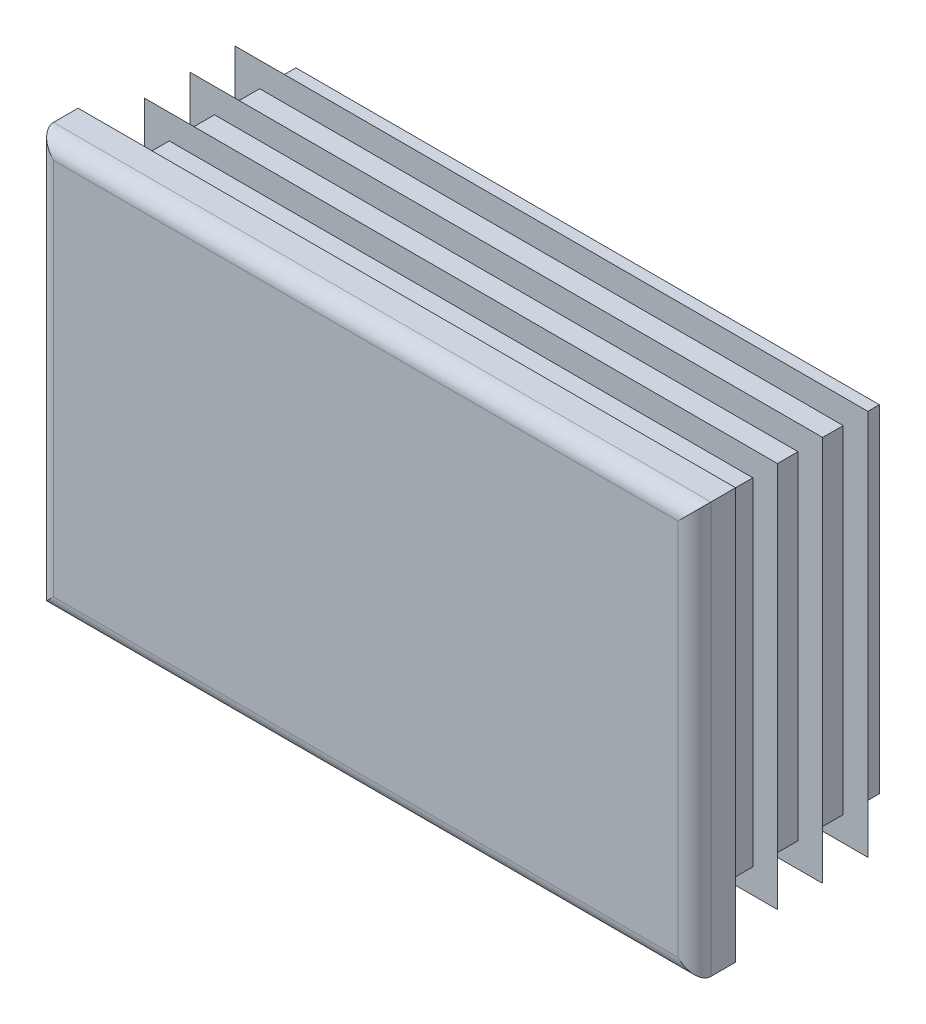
ISO-10303-21;
HEADER;
FILE_DESCRIPTION(('STEP AP214'),'2;1');
FILE_NAME('part.step','',(''),(''),'','','');
FILE_SCHEMA(('AUTOMOTIVE_DESIGN { 1 0 10303 214 1 1 1 1 }'));
ENDSEC;
DATA;
#1=APPLICATION_CONTEXT('core data for automotive mechanical design processes');
#2=APPLICATION_PROTOCOL_DEFINITION('international standard','automotive_design',2000,#1);
#3=PRODUCT_CONTEXT('',#1,'mechanical');
#4=PRODUCT('Part','Part','',(#3));
#5=PRODUCT_RELATED_PRODUCT_CATEGORY('part','',(#4));
#6=PRODUCT_DEFINITION_FORMATION('','',#4);
#7=PRODUCT_DEFINITION_CONTEXT('part definition',#1,'design');
#8=PRODUCT_DEFINITION('design','',#6,#7);
#9=PRODUCT_DEFINITION_SHAPE('','',#8);
#10=(LENGTH_UNIT() NAMED_UNIT(*) SI_UNIT(.MILLI.,.METRE.));
#11=(NAMED_UNIT(*) PLANE_ANGLE_UNIT() SI_UNIT($,.RADIAN.));
#12=(NAMED_UNIT(*) SI_UNIT($,.STERADIAN.) SOLID_ANGLE_UNIT());
#13=UNCERTAINTY_MEASURE_WITH_UNIT(LENGTH_MEASURE(1.E-05),#10,'distance_accuracy_value','');
#14=(GEOMETRIC_REPRESENTATION_CONTEXT(3) GLOBAL_UNCERTAINTY_ASSIGNED_CONTEXT((#13)) GLOBAL_UNIT_ASSIGNED_CONTEXT((#10,
#11,#12)) REPRESENTATION_CONTEXT('',''));
#15=CARTESIAN_POINT('',(0.,0.,0.));
#16=DIRECTION('',(0.,0.,1.));
#17=DIRECTION('',(1.,0.,0.));
#18=AXIS2_PLACEMENT_3D('',#15,#16,#17);
#19=CARTESIAN_POINT('',(38.,-25.,5.));
#20=DIRECTION('',(0.,0.,-1.));
#21=DIRECTION('',(0.,1.,0.));
#22=AXIS2_PLACEMENT_3D('',#19,#20,#21);
#23=PLANE('',#22);
#24=DIRECTION('',(0.,1.,0.));
#25=VECTOR('',#24,1.);
#26=CARTESIAN_POINT('',(-38.,-25.,5.));
#27=LINE('',#26,#25);
#28=CARTESIAN_POINT('',(-38.,-23.,5.));
#29=VERTEX_POINT('',#28);
#30=CARTESIAN_POINT('',(-38.,23.,5.));
#31=VERTEX_POINT('',#30);
#32=EDGE_CURVE('E310',#29,#31,#27,.T.);
#33=ORIENTED_EDGE('',*,*,#32,.F.);
#34=DIRECTION('',(-1.,0.,0.));
#35=VECTOR('',#34,1.);
#36=CARTESIAN_POINT('',(40.,-23.,5.));
#37=LINE('',#36,#35);
#38=CARTESIAN_POINT('',(38.,-23.,5.));
#39=VERTEX_POINT('',#38);
#40=EDGE_CURVE('E482',#39,#29,#37,.T.);
#41=ORIENTED_EDGE('',*,*,#40,.F.);
#42=DIRECTION('',(0.,1.,0.));
#43=VECTOR('',#42,1.);
#44=CARTESIAN_POINT('',(38.,-25.,5.));
#45=LINE('',#44,#43);
#46=CARTESIAN_POINT('',(38.,23.,5.));
#47=VERTEX_POINT('',#46);
#48=EDGE_CURVE('E305',#39,#47,#45,.T.);
#49=ORIENTED_EDGE('',*,*,#48,.T.);
#50=DIRECTION('',(-1.,0.,0.));
#51=VECTOR('',#50,1.);
#52=CARTESIAN_POINT('',(40.,23.,5.));
#53=LINE('',#52,#51);
#54=EDGE_CURVE('E630',#47,#31,#53,.T.);
#55=ORIENTED_EDGE('',*,*,#54,.T.);
#56=EDGE_LOOP('',(#33,#41,#49,#55));
#57=FACE_BOUND('',#56,.T.);
#58=ADVANCED_FACE('F14',(#57),#23,.F.);
#59=CARTESIAN_POINT('',(-38.,-25.,3.));
#60=DIRECTION('',(0.,1.,0.));
#61=DIRECTION('',(-1.,0.,0.));
#62=AXIS2_PLACEMENT_3D('',#59,#60,#61);
#63=CYLINDRICAL_SURFACE('',#62,2.);
#64=DIRECTION('',(0.,1.,0.));
#65=VECTOR('',#64,1.);
#66=CARTESIAN_POINT('',(-40.,-25.,3.));
#67=LINE('',#66,#65);
#68=CARTESIAN_POINT('',(-40.,-25.,3.));
#69=VERTEX_POINT('',#68);
#70=CARTESIAN_POINT('',(-40.,25.,3.));
#71=VERTEX_POINT('',#70);
#72=EDGE_CURVE('E402',#69,#71,#67,.T.);
#73=ORIENTED_EDGE('',*,*,#72,.F.);
#74=CARTESIAN_POINT('',(-38.,-23.,3.));
#75=DIRECTION('',(-0.707106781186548,0.707106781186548,0.));
#76=DIRECTION('',(0.707106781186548,0.707106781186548,0.));
#77=AXIS2_PLACEMENT_3D('',#74,#75,#76);
#78=ELLIPSE('',#77,2.82842712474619,2.);
#79=EDGE_CURVE('E59',#69,#29,#78,.T.);
#80=ORIENTED_EDGE('',*,*,#79,.T.);
#81=ORIENTED_EDGE('',*,*,#32,.T.);
#82=CARTESIAN_POINT('',(-38.,23.,3.));
#83=DIRECTION('',(0.707106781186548,0.707106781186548,0.));
#84=DIRECTION('',(-0.707106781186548,0.707106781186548,0.));
#85=AXIS2_PLACEMENT_3D('',#82,#83,#84);
#86=ELLIPSE('',#85,2.82842712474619,2.);
#87=EDGE_CURVE('E306',#31,#71,#86,.F.);
#88=ORIENTED_EDGE('',*,*,#87,.T.);
#89=EDGE_LOOP('',(#73,#80,#81,#88));
#90=FACE_BOUND('',#89,.T.);
#91=ADVANCED_FACE('F16',(#90),#63,.T.);
#92=CARTESIAN_POINT('',(-40.,-25.,3.));
#93=DIRECTION('',(1.,0.,0.));
#94=DIRECTION('',(0.,1.,0.));
#95=AXIS2_PLACEMENT_3D('',#92,#93,#94);
#96=PLANE('',#95);
#97=DIRECTION('',(0.,0.,-1.));
#98=VECTOR('',#97,1.);
#99=CARTESIAN_POINT('',(-40.,25.,3.));
#100=LINE('',#99,#98);
#101=CARTESIAN_POINT('',(-40.,25.,0.));
#102=VERTEX_POINT('',#101);
#103=EDGE_CURVE('E615',#71,#102,#100,.T.);
#104=ORIENTED_EDGE('',*,*,#103,.T.);
#105=DIRECTION('',(0.,1.,0.));
#106=VECTOR('',#105,1.);
#107=CARTESIAN_POINT('',(-40.,-25.,0.));
#108=LINE('',#107,#106);
#109=CARTESIAN_POINT('',(-40.,-25.,0.));
#110=VERTEX_POINT('',#109);
#111=EDGE_CURVE('E400',#110,#102,#108,.T.);
#112=ORIENTED_EDGE('',*,*,#111,.F.);
#113=DIRECTION('',(0.,0.,-1.));
#114=VECTOR('',#113,1.);
#115=CARTESIAN_POINT('',(-40.,-25.,3.));
#116=LINE('',#115,#114);
#117=EDGE_CURVE('E616',#69,#110,#116,.T.);
#118=ORIENTED_EDGE('',*,*,#117,.F.);
#119=ORIENTED_EDGE('',*,*,#72,.T.);
#120=EDGE_LOOP('',(#104,#112,#118,#119));
#121=FACE_BOUND('',#120,.T.);
#122=ADVANCED_FACE('F697',(#121),#96,.F.);
#123=CARTESIAN_POINT('',(-35.5,-25.,0.));
#124=DIRECTION('',(1.,0.,0.));
#125=DIRECTION('',(0.,1.,0.));
#126=AXIS2_PLACEMENT_3D('',#123,#124,#125);
#127=PLANE('',#126);
#128=DIRECTION('',(0.,1.,0.));
#129=VECTOR('',#128,1.);
#130=CARTESIAN_POINT('',(-35.5,-25.,0.));
#131=LINE('',#130,#129);
#132=CARTESIAN_POINT('',(-35.5,-20.5,0.));
#133=VERTEX_POINT('',#132);
#134=CARTESIAN_POINT('',(-35.5,20.5,0.));
#135=VERTEX_POINT('',#134);
#136=EDGE_CURVE('E397',#133,#135,#131,.T.);
#137=ORIENTED_EDGE('',*,*,#136,.T.);
#138=DIRECTION('',(0.,0.,-1.));
#139=VECTOR('',#138,1.);
#140=CARTESIAN_POINT('',(-35.5,20.5,0.));
#141=LINE('',#140,#139);
#142=CARTESIAN_POINT('',(-35.5,20.5,-1.1));
#143=VERTEX_POINT('',#142);
#144=EDGE_CURVE('E495',#135,#143,#141,.T.);
#145=ORIENTED_EDGE('',*,*,#144,.T.);
#146=DIRECTION('',(0.,1.,0.));
#147=VECTOR('',#146,1.);
#148=CARTESIAN_POINT('',(-35.5,-25.,-1.1));
#149=LINE('',#148,#147);
#150=CARTESIAN_POINT('',(-35.5,-20.5,-1.1));
#151=VERTEX_POINT('',#150);
#152=EDGE_CURVE('E394',#151,#143,#149,.T.);
#153=ORIENTED_EDGE('',*,*,#152,.F.);
#154=DIRECTION('',(0.,0.,1.));
#155=VECTOR('',#154,1.);
#156=CARTESIAN_POINT('',(-35.5,-20.5,0.));
#157=LINE('',#156,#155);
#158=EDGE_CURVE('E489',#151,#133,#157,.T.);
#159=ORIENTED_EDGE('',*,*,#158,.T.);
#160=EDGE_LOOP('',(#137,#145,#153,#159));
#161=FACE_BOUND('',#160,.T.);
#162=ADVANCED_FACE('F787',(#161),#127,.F.);
#163=CARTESIAN_POINT('',(-38.5,-25.,-1.1));
#164=DIRECTION('',(0.342020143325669,0.,0.939692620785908));
#165=DIRECTION('',(-0.939692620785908,0.,0.342020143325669));
#166=AXIS2_PLACEMENT_3D('',#163,#164,#165);
#167=PLANE('',#166);
#168=DIRECTION('',(0.,1.,0.));
#169=VECTOR('',#168,1.);
#170=CARTESIAN_POINT('',(-38.5,-25.,-1.1));
#171=LINE('',#170,#169);
#172=CARTESIAN_POINT('',(-38.5,-23.5,-1.1));
#173=VERTEX_POINT('',#172);
#174=CARTESIAN_POINT('',(-38.5,23.5,-1.1));
#175=VERTEX_POINT('',#174);
#176=EDGE_CURVE('E392',#173,#175,#171,.T.);
#177=ORIENTED_EDGE('',*,*,#176,.T.);
#178=DIRECTION('',(0.844349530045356,-0.438895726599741,-0.307318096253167));
#179=VECTOR('',#178,1.);
#180=CARTESIAN_POINT('',(-20.5268020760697,14.1574712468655,-7.64170905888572));
#181=LINE('',#180,#179);
#182=CARTESIAN_POINT('',(-35.5,21.9405899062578,-2.19191070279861));
#183=VERTEX_POINT('',#182);
#184=EDGE_CURVE('E519',#175,#183,#181,.T.);
#185=ORIENTED_EDGE('',*,*,#184,.T.);
#186=DIRECTION('',(0.,1.,0.));
#187=VECTOR('',#186,1.);
#188=CARTESIAN_POINT('',(-35.5,-25.,-2.19191070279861));
#189=LINE('',#188,#187);
#190=CARTESIAN_POINT('',(-35.5,-21.9405899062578,-2.19191070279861));
#191=VERTEX_POINT('',#190);
#192=EDGE_CURVE('E389',#191,#183,#189,.T.);
#193=ORIENTED_EDGE('',*,*,#192,.F.);
#194=DIRECTION('',(-0.844349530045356,-0.438895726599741,0.307318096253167));
#195=VECTOR('',#194,1.);
#196=CARTESIAN_POINT('',(-39.0558721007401,-23.7889441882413,-0.897679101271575));
#197=LINE('',#196,#195);
#198=EDGE_CURVE('E507',#191,#173,#197,.T.);
#199=ORIENTED_EDGE('',*,*,#198,.T.);
#200=EDGE_LOOP('',(#177,#185,#193,#199));
#201=FACE_BOUND('',#200,.T.);
#202=ADVANCED_FACE('F783',(#201),#167,.F.);
#203=CARTESIAN_POINT('',(-35.5,-25.,-2.19191070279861));
#204=DIRECTION('',(1.,0.,0.));
#205=DIRECTION('',(0.,1.,0.));
#206=AXIS2_PLACEMENT_3D('',#203,#204,#205);
#207=PLANE('',#206);
#208=ORIENTED_EDGE('',*,*,#192,.T.);
#209=DIRECTION('',(0.,-0.819152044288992,-0.573576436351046));
#210=VECTOR('',#209,1.);
#211=CARTESIAN_POINT('',(-35.5,-9.55701869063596,-24.2467736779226));
#212=LINE('',#211,#210);
#213=CARTESIAN_POINT('',(-35.5,20.5,-3.20062261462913));
#214=VERTEX_POINT('',#213);
#215=EDGE_CURVE('E516',#183,#214,#212,.T.);
#216=ORIENTED_EDGE('',*,*,#215,.T.);
#217=DIRECTION('',(0.,0.,-1.));
#218=VECTOR('',#217,1.);
#219=CARTESIAN_POINT('',(-35.5,20.5,-2.19191070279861));
#220=LINE('',#219,#218);
#221=CARTESIAN_POINT('',(-35.5,20.5,-6.6));
#222=VERTEX_POINT('',#221);
#223=EDGE_CURVE('E525',#214,#222,#220,.T.);
#224=ORIENTED_EDGE('',*,*,#223,.T.);
#225=DIRECTION('',(0.,1.,0.));
#226=VECTOR('',#225,1.);
#227=CARTESIAN_POINT('',(-35.5,-25.,-6.6));
#228=LINE('',#227,#226);
#229=CARTESIAN_POINT('',(-35.5,-20.5,-6.6));
#230=VERTEX_POINT('',#229);
#231=EDGE_CURVE('E386',#230,#222,#228,.T.);
#232=ORIENTED_EDGE('',*,*,#231,.F.);
#233=DIRECTION('',(0.,0.,1.));
#234=VECTOR('',#233,1.);
#235=CARTESIAN_POINT('',(-35.5,-20.5,-2.19191070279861));
#236=LINE('',#235,#234);
#237=CARTESIAN_POINT('',(-35.5,-20.5,-3.20062261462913));
#238=VERTEX_POINT('',#237);
#239=EDGE_CURVE('E522',#230,#238,#236,.T.);
#240=ORIENTED_EDGE('',*,*,#239,.T.);
#241=DIRECTION('',(0.,-0.819152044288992,0.573576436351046));
#242=VECTOR('',#241,1.);
#243=CARTESIAN_POINT('',(-35.5,-23.9934848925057,-0.754458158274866));
#244=LINE('',#243,#242);
#245=EDGE_CURVE('E504',#238,#191,#244,.T.);
#246=ORIENTED_EDGE('',*,*,#245,.T.);
#247=EDGE_LOOP('',(#208,#216,#224,#232,#240,#246));
#248=FACE_BOUND('',#247,.T.);
#249=ADVANCED_FACE('F779',(#248),#207,.F.);
#250=CARTESIAN_POINT('',(-38.5,-25.,-6.6));
#251=DIRECTION('',(0.342020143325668,0.,0.939692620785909));
#252=DIRECTION('',(-0.939692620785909,0.,0.342020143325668));
#253=AXIS2_PLACEMENT_3D('',#250,#251,#252);
#254=PLANE('',#253);
#255=DIRECTION('',(0.,1.,0.));
#256=VECTOR('',#255,1.);
#257=CARTESIAN_POINT('',(-38.5,-25.,-6.6));
#258=LINE('',#257,#256);
#259=CARTESIAN_POINT('',(-38.5,-23.5,-6.6));
#260=VERTEX_POINT('',#259);
#261=CARTESIAN_POINT('',(-38.5,23.5,-6.6));
#262=VERTEX_POINT('',#261);
#263=EDGE_CURVE('E384',#260,#262,#258,.T.);
#264=ORIENTED_EDGE('',*,*,#263,.T.);
#265=DIRECTION('',(0.844349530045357,-0.43889572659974,-0.307318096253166));
#266=VECTOR('',#265,1.);
#267=CARTESIAN_POINT('',(-20.5268020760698,14.1574712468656,-13.1417090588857));
#268=LINE('',#267,#266);
#269=CARTESIAN_POINT('',(-35.5,21.9405899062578,-7.6919107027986));
#270=VERTEX_POINT('',#269);
#271=EDGE_CURVE('E549',#262,#270,#268,.T.);
#272=ORIENTED_EDGE('',*,*,#271,.T.);
#273=DIRECTION('',(0.,1.,0.));
#274=VECTOR('',#273,1.);
#275=CARTESIAN_POINT('',(-35.5,-25.,-7.6919107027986));
#276=LINE('',#275,#274);
#277=CARTESIAN_POINT('',(-35.5,-21.9405899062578,-7.6919107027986));
#278=VERTEX_POINT('',#277);
#279=EDGE_CURVE('E381',#278,#270,#276,.T.);
#280=ORIENTED_EDGE('',*,*,#279,.F.);
#281=DIRECTION('',(-0.844349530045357,-0.43889572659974,0.307318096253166));
#282=VECTOR('',#281,1.);
#283=CARTESIAN_POINT('',(-39.0558721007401,-23.7889441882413,-6.39767910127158));
#284=LINE('',#283,#282);
#285=EDGE_CURVE('E537',#278,#260,#284,.T.);
#286=ORIENTED_EDGE('',*,*,#285,.T.);
#287=EDGE_LOOP('',(#264,#272,#280,#286));
#288=FACE_BOUND('',#287,.T.);
#289=ADVANCED_FACE('F775',(#288),#254,.F.);
#290=CARTESIAN_POINT('',(-35.5,-25.,-7.6919107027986));
#291=DIRECTION('',(1.,0.,0.));
#292=DIRECTION('',(0.,1.,0.));
#293=AXIS2_PLACEMENT_3D('',#290,#291,#292);
#294=PLANE('',#293);
#295=ORIENTED_EDGE('',*,*,#279,.T.);
#296=DIRECTION('',(0.,-0.819152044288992,-0.573576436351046));
#297=VECTOR('',#296,1.);
#298=CARTESIAN_POINT('',(-35.5,-9.55701869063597,-29.7467736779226));
#299=LINE('',#298,#297);
#300=CARTESIAN_POINT('',(-35.5,20.5,-8.70062261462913));
#301=VERTEX_POINT('',#300);
#302=EDGE_CURVE('E546',#270,#301,#299,.T.);
#303=ORIENTED_EDGE('',*,*,#302,.T.);
#304=DIRECTION('',(0.,0.,-1.));
#305=VECTOR('',#304,1.);
#306=CARTESIAN_POINT('',(-35.5,20.5,-7.6919107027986));
#307=LINE('',#306,#305);
#308=CARTESIAN_POINT('',(-35.5,20.5,-12.1));
#309=VERTEX_POINT('',#308);
#310=EDGE_CURVE('E555',#301,#309,#307,.T.);
#311=ORIENTED_EDGE('',*,*,#310,.T.);
#312=DIRECTION('',(0.,1.,0.));
#313=VECTOR('',#312,1.);
#314=CARTESIAN_POINT('',(-35.5,-25.,-12.1));
#315=LINE('',#314,#313);
#316=CARTESIAN_POINT('',(-35.5,-20.5,-12.1));
#317=VERTEX_POINT('',#316);
#318=EDGE_CURVE('E378',#317,#309,#315,.T.);
#319=ORIENTED_EDGE('',*,*,#318,.F.);
#320=DIRECTION('',(0.,0.,1.));
#321=VECTOR('',#320,1.);
#322=CARTESIAN_POINT('',(-35.5,-20.5,-7.6919107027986));
#323=LINE('',#322,#321);
#324=CARTESIAN_POINT('',(-35.5,-20.5,-8.70062261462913));
#325=VERTEX_POINT('',#324);
#326=EDGE_CURVE('E552',#317,#325,#323,.T.);
#327=ORIENTED_EDGE('',*,*,#326,.T.);
#328=DIRECTION('',(0.,-0.819152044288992,0.573576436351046));
#329=VECTOR('',#328,1.);
#330=CARTESIAN_POINT('',(-35.5,-23.9934848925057,-6.25445815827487));
#331=LINE('',#330,#329);
#332=EDGE_CURVE('E534',#325,#278,#331,.T.);
#333=ORIENTED_EDGE('',*,*,#332,.T.);
#334=EDGE_LOOP('',(#295,#303,#311,#319,#327,#333));
#335=FACE_BOUND('',#334,.T.);
#336=ADVANCED_FACE('F771',(#335),#294,.F.);
#337=CARTESIAN_POINT('',(-38.5,-25.,-12.1));
#338=DIRECTION('',(0.342020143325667,0.,0.939692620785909));
#339=DIRECTION('',(-0.939692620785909,0.,0.342020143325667));
#340=AXIS2_PLACEMENT_3D('',#337,#338,#339);
#341=PLANE('',#340);
#342=DIRECTION('',(0.,1.,0.));
#343=VECTOR('',#342,1.);
#344=CARTESIAN_POINT('',(-38.5,-25.,-12.1));
#345=LINE('',#344,#343);
#346=CARTESIAN_POINT('',(-38.5,-23.5,-12.1));
#347=VERTEX_POINT('',#346);
#348=CARTESIAN_POINT('',(-38.5,23.5,-12.1));
#349=VERTEX_POINT('',#348);
#350=EDGE_CURVE('E376',#347,#349,#345,.T.);
#351=ORIENTED_EDGE('',*,*,#350,.T.);
#352=DIRECTION('',(0.844349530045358,-0.438895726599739,-0.307318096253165));
#353=VECTOR('',#352,1.);
#354=CARTESIAN_POINT('',(-20.5268020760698,14.1574712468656,-18.6417090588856));
#355=LINE('',#354,#353);
#356=CARTESIAN_POINT('',(-35.5,21.9405899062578,-13.1919107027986));
#357=VERTEX_POINT('',#356);
#358=EDGE_CURVE('E579',#349,#357,#355,.T.);
#359=ORIENTED_EDGE('',*,*,#358,.T.);
#360=DIRECTION('',(0.,1.,0.));
#361=VECTOR('',#360,1.);
#362=CARTESIAN_POINT('',(-35.5,-25.,-13.1919107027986));
#363=LINE('',#362,#361);
#364=CARTESIAN_POINT('',(-35.5,-21.9405899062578,-13.1919107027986));
#365=VERTEX_POINT('',#364);
#366=EDGE_CURVE('E373',#365,#357,#363,.T.);
#367=ORIENTED_EDGE('',*,*,#366,.F.);
#368=DIRECTION('',(-0.844349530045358,-0.438895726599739,0.307318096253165));
#369=VECTOR('',#368,1.);
#370=CARTESIAN_POINT('',(-39.0558721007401,-23.7889441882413,-11.8976791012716));
#371=LINE('',#370,#369);
#372=EDGE_CURVE('E567',#365,#347,#371,.T.);
#373=ORIENTED_EDGE('',*,*,#372,.T.);
#374=EDGE_LOOP('',(#351,#359,#367,#373));
#375=FACE_BOUND('',#374,.T.);
#376=ADVANCED_FACE('F767',(#375),#341,.F.);
#377=CARTESIAN_POINT('',(-35.5,-25.,-13.1919107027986));
#378=DIRECTION('',(1.,0.,0.));
#379=DIRECTION('',(0.,1.,0.));
#380=AXIS2_PLACEMENT_3D('',#377,#378,#379);
#381=PLANE('',#380);
#382=ORIENTED_EDGE('',*,*,#366,.T.);
#383=DIRECTION('',(0.,-0.819152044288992,-0.573576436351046));
#384=VECTOR('',#383,1.);
#385=CARTESIAN_POINT('',(-35.5,-9.55701869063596,-35.2467736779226));
#386=LINE('',#385,#384);
#387=CARTESIAN_POINT('',(-35.5,20.5,-14.2006226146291));
#388=VERTEX_POINT('',#387);
#389=EDGE_CURVE('E576',#357,#388,#386,.T.);
#390=ORIENTED_EDGE('',*,*,#389,.T.);
#391=DIRECTION('',(0.,0.,-1.));
#392=VECTOR('',#391,1.);
#393=CARTESIAN_POINT('',(-35.5,20.5,-13.1919107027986));
#394=LINE('',#393,#392);
#395=CARTESIAN_POINT('',(-35.5,20.5,-17.6));
#396=VERTEX_POINT('',#395);
#397=EDGE_CURVE('E585',#388,#396,#394,.T.);
#398=ORIENTED_EDGE('',*,*,#397,.T.);
#399=DIRECTION('',(0.,1.,0.));
#400=VECTOR('',#399,1.);
#401=CARTESIAN_POINT('',(-35.5,-25.,-17.6));
#402=LINE('',#401,#400);
#403=CARTESIAN_POINT('',(-35.5,-20.5,-17.6));
#404=VERTEX_POINT('',#403);
#405=EDGE_CURVE('E370',#404,#396,#402,.T.);
#406=ORIENTED_EDGE('',*,*,#405,.F.);
#407=DIRECTION('',(0.,0.,1.));
#408=VECTOR('',#407,1.);
#409=CARTESIAN_POINT('',(-35.5,-20.5,-13.1919107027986));
#410=LINE('',#409,#408);
#411=CARTESIAN_POINT('',(-35.5,-20.5,-14.2006226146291));
#412=VERTEX_POINT('',#411);
#413=EDGE_CURVE('E582',#404,#412,#410,.T.);
#414=ORIENTED_EDGE('',*,*,#413,.T.);
#415=DIRECTION('',(0.,-0.819152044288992,0.573576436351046));
#416=VECTOR('',#415,1.);
#417=CARTESIAN_POINT('',(-35.5,-23.9934848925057,-11.7544581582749));
#418=LINE('',#417,#416);
#419=EDGE_CURVE('E564',#412,#365,#418,.T.);
#420=ORIENTED_EDGE('',*,*,#419,.T.);
#421=EDGE_LOOP('',(#382,#390,#398,#406,#414,#420));
#422=FACE_BOUND('',#421,.T.);
#423=ADVANCED_FACE('F764',(#422),#381,.F.);
#424=CARTESIAN_POINT('',(-38.5,-25.,-17.6));
#425=DIRECTION('',(0.342020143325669,0.,0.939692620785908));
#426=DIRECTION('',(-0.939692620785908,0.,0.342020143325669));
#427=AXIS2_PLACEMENT_3D('',#424,#425,#426);
#428=PLANE('',#427);
#429=DIRECTION('',(0.,1.,0.));
#430=VECTOR('',#429,1.);
#431=CARTESIAN_POINT('',(-38.5,-25.,-17.6));
#432=LINE('',#431,#430);
#433=CARTESIAN_POINT('',(-38.5,-23.5,-17.6));
#434=VERTEX_POINT('',#433);
#435=CARTESIAN_POINT('',(-38.5,23.5,-17.6));
#436=VERTEX_POINT('',#435);
#437=EDGE_CURVE('E368',#434,#436,#432,.T.);
#438=ORIENTED_EDGE('',*,*,#437,.T.);
#439=DIRECTION('',(0.844349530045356,-0.438895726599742,-0.307318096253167));
#440=VECTOR('',#439,1.);
#441=CARTESIAN_POINT('',(-20.5268020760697,14.1574712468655,-24.1417090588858));
#442=LINE('',#441,#440);
#443=CARTESIAN_POINT('',(-35.5,21.9405899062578,-18.6919107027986));
#444=VERTEX_POINT('',#443);
#445=EDGE_CURVE('E607',#436,#444,#442,.T.);
#446=ORIENTED_EDGE('',*,*,#445,.T.);
#447=DIRECTION('',(0.,1.,0.));
#448=VECTOR('',#447,1.);
#449=CARTESIAN_POINT('',(-35.5,-25.,-18.6919107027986));
#450=LINE('',#449,#448);
#451=CARTESIAN_POINT('',(-35.5,-21.9405899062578,-18.6919107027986));
#452=VERTEX_POINT('',#451);
#453=EDGE_CURVE('E365',#452,#444,#450,.T.);
#454=ORIENTED_EDGE('',*,*,#453,.F.);
#455=DIRECTION('',(-0.844349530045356,-0.438895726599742,0.307318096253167));
#456=VECTOR('',#455,1.);
#457=CARTESIAN_POINT('',(-39.0558721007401,-23.7889441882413,-17.3976791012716));
#458=LINE('',#457,#456);
#459=EDGE_CURVE('E595',#452,#434,#458,.T.);
#460=ORIENTED_EDGE('',*,*,#459,.T.);
#461=EDGE_LOOP('',(#438,#446,#454,#460));
#462=FACE_BOUND('',#461,.T.);
#463=ADVANCED_FACE('F675',(#462),#428,.F.);
#464=CARTESIAN_POINT('',(-35.5,-25.,-18.6919107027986));
#465=DIRECTION('',(1.,0.,0.));
#466=DIRECTION('',(0.,1.,0.));
#467=AXIS2_PLACEMENT_3D('',#464,#465,#466);
#468=PLANE('',#467);
#469=ORIENTED_EDGE('',*,*,#453,.T.);
#470=DIRECTION('',(0.,-0.819152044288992,-0.573576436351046));
#471=VECTOR('',#470,1.);
#472=CARTESIAN_POINT('',(-35.5,-9.55701869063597,-40.7467736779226));
#473=LINE('',#472,#471);
#474=CARTESIAN_POINT('',(-35.5,20.5,-19.7006226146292));
#475=VERTEX_POINT('',#474);
#476=EDGE_CURVE('E604',#444,#475,#473,.T.);
#477=ORIENTED_EDGE('',*,*,#476,.T.);
#478=DIRECTION('',(0.,0.,-1.));
#479=VECTOR('',#478,1.);
#480=CARTESIAN_POINT('',(-35.5,20.5,-18.6919107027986));
#481=LINE('',#480,#479);
#482=CARTESIAN_POINT('',(-35.5,20.5,-22.));
#483=VERTEX_POINT('',#482);
#484=EDGE_CURVE('E613',#475,#483,#481,.T.);
#485=ORIENTED_EDGE('',*,*,#484,.T.);
#486=DIRECTION('',(0.,1.,0.));
#487=VECTOR('',#486,1.);
#488=CARTESIAN_POINT('',(-35.5,-25.,-22.));
#489=LINE('',#488,#487);
#490=CARTESIAN_POINT('',(-35.5,-20.5,-22.));
#491=VERTEX_POINT('',#490);
#492=EDGE_CURVE('E362',#491,#483,#489,.T.);
#493=ORIENTED_EDGE('',*,*,#492,.F.);
#494=DIRECTION('',(0.,0.,1.));
#495=VECTOR('',#494,1.);
#496=CARTESIAN_POINT('',(-35.5,-20.5,-18.6919107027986));
#497=LINE('',#496,#495);
#498=CARTESIAN_POINT('',(-35.5,-20.5,-19.7006226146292));
#499=VERTEX_POINT('',#498);
#500=EDGE_CURVE('E610',#491,#499,#497,.T.);
#501=ORIENTED_EDGE('',*,*,#500,.T.);
#502=DIRECTION('',(0.,-0.819152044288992,0.573576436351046));
#503=VECTOR('',#502,1.);
#504=CARTESIAN_POINT('',(-35.5,-23.9934848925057,-17.2544581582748));
#505=LINE('',#504,#503);
#506=EDGE_CURVE('E592',#499,#452,#505,.T.);
#507=ORIENTED_EDGE('',*,*,#506,.T.);
#508=EDGE_LOOP('',(#469,#477,#485,#493,#501,#507));
#509=FACE_BOUND('',#508,.T.);
#510=ADVANCED_FACE('F677',(#509),#468,.F.);
#511=CARTESIAN_POINT('',(-35.5,-25.,-22.));
#512=DIRECTION('',(0.,0.,1.));
#513=DIRECTION('',(0.,-1.,0.));
#514=AXIS2_PLACEMENT_3D('',#511,#512,#513);
#515=PLANE('',#514);
#516=ORIENTED_EDGE('',*,*,#492,.T.);
#517=DIRECTION('',(-1.,0.,0.));
#518=VECTOR('',#517,1.);
#519=CARTESIAN_POINT('',(40.,20.5,-22.));
#520=LINE('',#519,#518);
#521=CARTESIAN_POINT('',(35.5,20.5,-22.));
#522=VERTEX_POINT('',#521);
#523=EDGE_CURVE('E438',#522,#483,#520,.T.);
#524=ORIENTED_EDGE('',*,*,#523,.F.);
#525=DIRECTION('',(0.,1.,0.));
#526=VECTOR('',#525,1.);
#527=CARTESIAN_POINT('',(35.5,-25.,-22.));
#528=LINE('',#527,#526);
#529=CARTESIAN_POINT('',(35.5,-20.5,-22.));
#530=VERTEX_POINT('',#529);
#531=EDGE_CURVE('E359',#530,#522,#528,.T.);
#532=ORIENTED_EDGE('',*,*,#531,.F.);
#533=DIRECTION('',(-1.,0.,0.));
#534=VECTOR('',#533,1.);
#535=CARTESIAN_POINT('',(40.,-20.5,-22.));
#536=LINE('',#535,#534);
#537=EDGE_CURVE('E436',#530,#491,#536,.T.);
#538=ORIENTED_EDGE('',*,*,#537,.T.);
#539=EDGE_LOOP('',(#516,#524,#532,#538));
#540=FACE_BOUND('',#539,.T.);
#541=ADVANCED_FACE('F435',(#540),#515,.F.);
#542=CARTESIAN_POINT('',(35.5,-25.,-22.));
#543=DIRECTION('',(-1.,0.,0.));
#544=DIRECTION('',(0.,-1.,0.));
#545=AXIS2_PLACEMENT_3D('',#542,#543,#544);
#546=PLANE('',#545);
#547=DIRECTION('',(0.,0.,1.));
#548=VECTOR('',#547,1.);
#549=CARTESIAN_POINT('',(35.5,20.5,-22.));
#550=LINE('',#549,#548);
#551=CARTESIAN_POINT('',(35.5,20.5,-19.7006226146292));
#552=VERTEX_POINT('',#551);
#553=EDGE_CURVE('E9',#522,#552,#550,.T.);
#554=ORIENTED_EDGE('',*,*,#553,.T.);
#555=DIRECTION('',(0.,0.819152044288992,0.573576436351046));
#556=VECTOR('',#555,1.);
#557=CARTESIAN_POINT('',(35.5,-11.1113122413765,-41.8351017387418));
#558=LINE('',#557,#556);
#559=CARTESIAN_POINT('',(35.5,21.9405899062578,-18.6919107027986));
#560=VERTEX_POINT('',#559);
#561=EDGE_CURVE('E601',#552,#560,#558,.T.);
#562=ORIENTED_EDGE('',*,*,#561,.T.);
#563=DIRECTION('',(0.,1.,0.));
#564=VECTOR('',#563,1.);
#565=CARTESIAN_POINT('',(35.5,-25.,-18.6919107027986));
#566=LINE('',#565,#564);
#567=CARTESIAN_POINT('',(35.5,-21.9405899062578,-18.6919107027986));
#568=VERTEX_POINT('',#567);
#569=EDGE_CURVE('E356',#568,#560,#566,.T.);
#570=ORIENTED_EDGE('',*,*,#569,.F.);
#571=DIRECTION('',(0.,0.819152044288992,-0.573576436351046));
#572=VECTOR('',#571,1.);
#573=CARTESIAN_POINT('',(35.5,-22.4391913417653,-18.3427862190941));
#574=LINE('',#573,#572);
#575=CARTESIAN_POINT('',(35.5,-20.5,-19.7006226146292));
#576=VERTEX_POINT('',#575);
#577=EDGE_CURVE('E428',#568,#576,#574,.T.);
#578=ORIENTED_EDGE('',*,*,#577,.T.);
#579=DIRECTION('',(0.,0.,-1.));
#580=VECTOR('',#579,1.);
#581=CARTESIAN_POINT('',(35.5,-20.5,-22.));
#582=LINE('',#581,#580);
#583=EDGE_CURVE('E23',#576,#530,#582,.T.);
#584=ORIENTED_EDGE('',*,*,#583,.T.);
#585=ORIENTED_EDGE('',*,*,#531,.T.);
#586=EDGE_LOOP('',(#554,#562,#570,#578,#584,#585));
#587=FACE_BOUND('',#586,.T.);
#588=ADVANCED_FACE('F426',(#587),#546,.F.);
#589=CARTESIAN_POINT('',(35.5,-25.,-18.6919107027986));
#590=DIRECTION('',(-0.342020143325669,0.,0.939692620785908));
#591=DIRECTION('',(-0.939692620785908,0.,-0.342020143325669));
#592=AXIS2_PLACEMENT_3D('',#589,#590,#591);
#593=PLANE('',#592);
#594=ORIENTED_EDGE('',*,*,#569,.T.);
#595=DIRECTION('',(0.844349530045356,0.438895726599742,0.307318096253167));
#596=VECTOR('',#595,1.);
#597=CARTESIAN_POINT('',(18.1046904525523,12.898449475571,-25.0232855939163));
#598=LINE('',#597,#596);
#599=CARTESIAN_POINT('',(38.5,23.5,-17.6));
#600=VERTEX_POINT('',#599);
#601=EDGE_CURVE('E598',#560,#600,#598,.T.);
#602=ORIENTED_EDGE('',*,*,#601,.T.);
#603=DIRECTION('',(0.,1.,0.));
#604=VECTOR('',#603,1.);
#605=CARTESIAN_POINT('',(38.5,-25.,-17.6));
#606=LINE('',#605,#604);
#607=CARTESIAN_POINT('',(38.5,-23.5,-17.6));
#608=VERTEX_POINT('',#607);
#609=EDGE_CURVE('E353',#608,#600,#606,.T.);
#610=ORIENTED_EDGE('',*,*,#609,.F.);
#611=DIRECTION('',(-0.844349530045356,0.438895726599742,-0.307318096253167));
#612=VECTOR('',#611,1.);
#613=CARTESIAN_POINT('',(36.6337604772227,-22.5299224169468,-18.2792556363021));
#614=LINE('',#613,#612);
#615=EDGE_CURVE('E588',#608,#568,#614,.T.);
#616=ORIENTED_EDGE('',*,*,#615,.T.);
#617=EDGE_LOOP('',(#594,#602,#610,#616));
#618=FACE_BOUND('',#617,.T.);
#619=ADVANCED_FACE('F752',(#618),#593,.F.);
#620=CARTESIAN_POINT('',(38.5,-25.,-17.6));
#621=DIRECTION('',(0.,0.,-1.));
#622=DIRECTION('',(0.,1.,0.));
#623=AXIS2_PLACEMENT_3D('',#620,#621,#622);
#624=PLANE('',#623);
#625=ORIENTED_EDGE('',*,*,#609,.T.);
#626=DIRECTION('',(-1.,0.,0.));
#627=VECTOR('',#626,1.);
#628=CARTESIAN_POINT('',(40.,23.5,-17.6));
#629=LINE('',#628,#627);
#630=EDGE_CURVE('E444',#600,#436,#629,.T.);
#631=ORIENTED_EDGE('',*,*,#630,.T.);
#632=ORIENTED_EDGE('',*,*,#437,.F.);
#633=DIRECTION('',(-1.,0.,0.));
#634=VECTOR('',#633,1.);
#635=CARTESIAN_POINT('',(40.,-23.5,-17.6));
#636=LINE('',#635,#634);
#637=EDGE_CURVE('E451',#608,#434,#636,.T.);
#638=ORIENTED_EDGE('',*,*,#637,.F.);
#639=EDGE_LOOP('',(#625,#631,#632,#638));
#640=FACE_BOUND('',#639,.T.);
#641=ORIENTED_EDGE('',*,*,#405,.T.);
#642=DIRECTION('',(-1.,0.,0.));
#643=VECTOR('',#642,1.);
#644=CARTESIAN_POINT('',(40.,20.5,-17.6));
#645=LINE('',#644,#643);
#646=CARTESIAN_POINT('',(35.5,20.5,-17.6));
#647=VERTEX_POINT('',#646);
#648=EDGE_CURVE('E663',#647,#396,#645,.T.);
#649=ORIENTED_EDGE('',*,*,#648,.F.);
#650=DIRECTION('',(0.,1.,0.));
#651=VECTOR('',#650,1.);
#652=CARTESIAN_POINT('',(35.5,-25.,-17.6));
#653=LINE('',#652,#651);
#654=CARTESIAN_POINT('',(35.5,-20.5,-17.6));
#655=VERTEX_POINT('',#654);
#656=EDGE_CURVE('E350',#655,#647,#653,.T.);
#657=ORIENTED_EDGE('',*,*,#656,.F.);
#658=DIRECTION('',(-1.,0.,0.));
#659=VECTOR('',#658,1.);
#660=CARTESIAN_POINT('',(40.,-20.5,-17.6));
#661=LINE('',#660,#659);
#662=EDGE_CURVE('E453',#655,#404,#661,.T.);
#663=ORIENTED_EDGE('',*,*,#662,.T.);
#664=EDGE_LOOP('',(#641,#649,#657,#663));
#665=FACE_BOUND('',#664,.T.);
#666=ADVANCED_FACE('F667',(#640,#665),#624,.F.);
#667=CARTESIAN_POINT('',(35.5,-25.,-17.6));
#668=DIRECTION('',(-1.,0.,0.));
#669=DIRECTION('',(0.,-1.,0.));
#670=AXIS2_PLACEMENT_3D('',#667,#668,#669);
#671=PLANE('',#670);
#672=DIRECTION('',(0.,0.,1.));
#673=VECTOR('',#672,1.);
#674=CARTESIAN_POINT('',(35.5,20.5,-17.6));
#675=LINE('',#674,#673);
#676=CARTESIAN_POINT('',(35.5,20.5,-14.2006226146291));
#677=VERTEX_POINT('',#676);
#678=EDGE_CURVE('E420',#647,#677,#675,.T.);
#679=ORIENTED_EDGE('',*,*,#678,.T.);
#680=DIRECTION('',(0.,0.819152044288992,0.573576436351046));
#681=VECTOR('',#680,1.);
#682=CARTESIAN_POINT('',(35.5,-11.6281431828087,-36.6969906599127));
#683=LINE('',#682,#681);
#684=CARTESIAN_POINT('',(35.5,21.9405899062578,-13.1919107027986));
#685=VERTEX_POINT('',#684);
#686=EDGE_CURVE('E573',#677,#685,#683,.T.);
#687=ORIENTED_EDGE('',*,*,#686,.T.);
#688=DIRECTION('',(0.,1.,0.));
#689=VECTOR('',#688,1.);
#690=CARTESIAN_POINT('',(35.5,-25.,-13.1919107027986));
#691=LINE('',#690,#689);
#692=CARTESIAN_POINT('',(35.5,-21.9405899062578,-13.1919107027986));
#693=VERTEX_POINT('',#692);
#694=EDGE_CURVE('E347',#693,#685,#691,.T.);
#695=ORIENTED_EDGE('',*,*,#694,.F.);
#696=DIRECTION('',(0.,0.819152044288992,-0.573576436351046));
#697=VECTOR('',#696,1.);
#698=CARTESIAN_POINT('',(35.5,-21.922360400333,-13.204675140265));
#699=LINE('',#698,#697);
#700=CARTESIAN_POINT('',(35.5,-20.5,-14.2006226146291));
#701=VERTEX_POINT('',#700);
#702=EDGE_CURVE('E561',#693,#701,#699,.T.);
#703=ORIENTED_EDGE('',*,*,#702,.T.);
#704=DIRECTION('',(0.,0.,-1.));
#705=VECTOR('',#704,1.);
#706=CARTESIAN_POINT('',(35.5,-20.5,-17.6));
#707=LINE('',#706,#705);
#708=EDGE_CURVE('E417',#701,#655,#707,.T.);
#709=ORIENTED_EDGE('',*,*,#708,.T.);
#710=ORIENTED_EDGE('',*,*,#656,.T.);
#711=EDGE_LOOP('',(#679,#687,#695,#703,#709,#710));
#712=FACE_BOUND('',#711,.T.);
#713=ADVANCED_FACE('F745',(#712),#671,.F.);
#714=CARTESIAN_POINT('',(35.5,-25.,-13.1919107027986));
#715=DIRECTION('',(-0.342020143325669,0.,0.939692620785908));
#716=DIRECTION('',(-0.939692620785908,0.,-0.342020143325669));
#717=AXIS2_PLACEMENT_3D('',#714,#715,#716);
#718=PLANE('',#717);
#719=ORIENTED_EDGE('',*,*,#694,.T.);
#720=DIRECTION('',(0.844349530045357,0.438895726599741,0.307318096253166));
#721=VECTOR('',#720,1.);
#722=CARTESIAN_POINT('',(18.1046904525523,12.8984494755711,-19.5232855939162));
#723=LINE('',#722,#721);
#724=CARTESIAN_POINT('',(38.5,23.5,-12.1));
#725=VERTEX_POINT('',#724);
#726=EDGE_CURVE('E570',#685,#725,#723,.T.);
#727=ORIENTED_EDGE('',*,*,#726,.T.);
#728=DIRECTION('',(0.,1.,0.));
#729=VECTOR('',#728,1.);
#730=CARTESIAN_POINT('',(38.5,-25.,-12.1));
#731=LINE('',#730,#729);
#732=CARTESIAN_POINT('',(38.5,-23.5,-12.1));
#733=VERTEX_POINT('',#732);
#734=EDGE_CURVE('E344',#733,#725,#731,.T.);
#735=ORIENTED_EDGE('',*,*,#734,.F.);
#736=DIRECTION('',(-0.844349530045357,0.438895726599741,-0.307318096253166));
#737=VECTOR('',#736,1.);
#738=CARTESIAN_POINT('',(36.6337604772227,-22.5299224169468,-12.7792556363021));
#739=LINE('',#738,#737);
#740=EDGE_CURVE('E558',#733,#693,#739,.T.);
#741=ORIENTED_EDGE('',*,*,#740,.T.);
#742=EDGE_LOOP('',(#719,#727,#735,#741));
#743=FACE_BOUND('',#742,.T.);
#744=ADVANCED_FACE('F741',(#743),#718,.F.);
#745=CARTESIAN_POINT('',(38.5,-25.,-12.1));
#746=DIRECTION('',(0.,0.,-1.));
#747=DIRECTION('',(0.,1.,0.));
#748=AXIS2_PLACEMENT_3D('',#745,#746,#747);
#749=PLANE('',#748);
#750=ORIENTED_EDGE('',*,*,#734,.T.);
#751=DIRECTION('',(-1.,0.,0.));
#752=VECTOR('',#751,1.);
#753=CARTESIAN_POINT('',(40.,23.5,-12.1));
#754=LINE('',#753,#752);
#755=EDGE_CURVE('E657',#725,#349,#754,.T.);
#756=ORIENTED_EDGE('',*,*,#755,.T.);
#757=ORIENTED_EDGE('',*,*,#350,.F.);
#758=DIRECTION('',(-1.,0.,0.));
#759=VECTOR('',#758,1.);
#760=CARTESIAN_POINT('',(40.,-23.5,-12.1));
#761=LINE('',#760,#759);
#762=EDGE_CURVE('E459',#733,#347,#761,.T.);
#763=ORIENTED_EDGE('',*,*,#762,.F.);
#764=EDGE_LOOP('',(#750,#756,#757,#763));
#765=FACE_BOUND('',#764,.T.);
#766=ORIENTED_EDGE('',*,*,#318,.T.);
#767=DIRECTION('',(-1.,0.,0.));
#768=VECTOR('',#767,1.);
#769=CARTESIAN_POINT('',(40.,20.5,-12.1));
#770=LINE('',#769,#768);
#771=CARTESIAN_POINT('',(35.5,20.5,-12.1));
#772=VERTEX_POINT('',#771);
#773=EDGE_CURVE('E655',#772,#309,#770,.T.);
#774=ORIENTED_EDGE('',*,*,#773,.F.);
#775=DIRECTION('',(0.,1.,0.));
#776=VECTOR('',#775,1.);
#777=CARTESIAN_POINT('',(35.5,-25.,-12.1));
#778=LINE('',#777,#776);
#779=CARTESIAN_POINT('',(35.5,-20.5,-12.1));
#780=VERTEX_POINT('',#779);
#781=EDGE_CURVE('E341',#780,#772,#778,.T.);
#782=ORIENTED_EDGE('',*,*,#781,.F.);
#783=DIRECTION('',(-1.,0.,0.));
#784=VECTOR('',#783,1.);
#785=CARTESIAN_POINT('',(40.,-20.5,-12.1));
#786=LINE('',#785,#784);
#787=EDGE_CURVE('E461',#780,#317,#786,.T.);
#788=ORIENTED_EDGE('',*,*,#787,.T.);
#789=EDGE_LOOP('',(#766,#774,#782,#788));
#790=FACE_BOUND('',#789,.T.);
#791=ADVANCED_FACE('F737',(#765,#790),#749,.F.);
#792=CARTESIAN_POINT('',(35.5,-25.,-12.1));
#793=DIRECTION('',(-1.,0.,0.));
#794=DIRECTION('',(0.,-1.,0.));
#795=AXIS2_PLACEMENT_3D('',#792,#793,#794);
#796=PLANE('',#795);
#797=DIRECTION('',(0.,0.,1.));
#798=VECTOR('',#797,1.);
#799=CARTESIAN_POINT('',(35.5,20.5,-12.1));
#800=LINE('',#799,#798);
#801=CARTESIAN_POINT('',(35.5,20.5,-8.70062261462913));
#802=VERTEX_POINT('',#801);
#803=EDGE_CURVE('E414',#772,#802,#800,.T.);
#804=ORIENTED_EDGE('',*,*,#803,.T.);
#805=DIRECTION('',(0.,0.819152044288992,0.573576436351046));
#806=VECTOR('',#805,1.);
#807=CARTESIAN_POINT('',(35.5,-11.6281431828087,-31.1969906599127));
#808=LINE('',#807,#806);
#809=CARTESIAN_POINT('',(35.5,21.9405899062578,-7.69191070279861));
#810=VERTEX_POINT('',#809);
#811=EDGE_CURVE('E543',#802,#810,#808,.T.);
#812=ORIENTED_EDGE('',*,*,#811,.T.);
#813=DIRECTION('',(0.,1.,0.));
#814=VECTOR('',#813,1.);
#815=CARTESIAN_POINT('',(35.5,-25.,-7.69191070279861));
#816=LINE('',#815,#814);
#817=CARTESIAN_POINT('',(35.5,-21.9405899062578,-7.69191070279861));
#818=VERTEX_POINT('',#817);
#819=EDGE_CURVE('E338',#818,#810,#816,.T.);
#820=ORIENTED_EDGE('',*,*,#819,.F.);
#821=DIRECTION('',(0.,0.819152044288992,-0.573576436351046));
#822=VECTOR('',#821,1.);
#823=CARTESIAN_POINT('',(35.5,-21.922360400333,-7.70467514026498));
#824=LINE('',#823,#822);
#825=CARTESIAN_POINT('',(35.5,-20.5,-8.70062261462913));
#826=VERTEX_POINT('',#825);
#827=EDGE_CURVE('E531',#818,#826,#824,.T.);
#828=ORIENTED_EDGE('',*,*,#827,.T.);
#829=DIRECTION('',(0.,0.,-1.));
#830=VECTOR('',#829,1.);
#831=CARTESIAN_POINT('',(35.5,-20.5,-12.1));
#832=LINE('',#831,#830);
#833=EDGE_CURVE('E411',#826,#780,#832,.T.);
#834=ORIENTED_EDGE('',*,*,#833,.T.);
#835=ORIENTED_EDGE('',*,*,#781,.T.);
#836=EDGE_LOOP('',(#804,#812,#820,#828,#834,#835));
#837=FACE_BOUND('',#836,.T.);
#838=ADVANCED_FACE('F733',(#837),#796,.F.);
#839=CARTESIAN_POINT('',(35.5,-25.,-7.69191070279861));
#840=DIRECTION('',(-0.342020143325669,0.,0.939692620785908));
#841=DIRECTION('',(-0.939692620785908,0.,-0.342020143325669));
#842=AXIS2_PLACEMENT_3D('',#839,#840,#841);
#843=PLANE('',#842);
#844=ORIENTED_EDGE('',*,*,#819,.T.);
#845=DIRECTION('',(0.844349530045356,0.438895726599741,0.307318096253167));
#846=VECTOR('',#845,1.);
#847=CARTESIAN_POINT('',(18.1046904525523,12.898449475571,-14.0232855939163));
#848=LINE('',#847,#846);
#849=CARTESIAN_POINT('',(38.5,23.5,-6.6));
#850=VERTEX_POINT('',#849);
#851=EDGE_CURVE('E540',#810,#850,#848,.T.);
#852=ORIENTED_EDGE('',*,*,#851,.T.);
#853=DIRECTION('',(0.,1.,0.));
#854=VECTOR('',#853,1.);
#855=CARTESIAN_POINT('',(38.5,-25.,-6.6));
#856=LINE('',#855,#854);
#857=CARTESIAN_POINT('',(38.5,-23.5,-6.6));
#858=VERTEX_POINT('',#857);
#859=EDGE_CURVE('E335',#858,#850,#856,.T.);
#860=ORIENTED_EDGE('',*,*,#859,.F.);
#861=DIRECTION('',(-0.844349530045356,0.438895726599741,-0.307318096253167));
#862=VECTOR('',#861,1.);
#863=CARTESIAN_POINT('',(36.6337604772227,-22.5299224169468,-7.27925563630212));
#864=LINE('',#863,#862);
#865=EDGE_CURVE('E528',#858,#818,#864,.T.);
#866=ORIENTED_EDGE('',*,*,#865,.T.);
#867=EDGE_LOOP('',(#844,#852,#860,#866));
#868=FACE_BOUND('',#867,.T.);
#869=ADVANCED_FACE('F729',(#868),#843,.F.);
#870=CARTESIAN_POINT('',(38.5,-25.,-6.6));
#871=DIRECTION('',(0.,0.,-1.));
#872=DIRECTION('',(0.,1.,0.));
#873=AXIS2_PLACEMENT_3D('',#870,#871,#872);
#874=PLANE('',#873);
#875=ORIENTED_EDGE('',*,*,#859,.T.);
#876=DIRECTION('',(-1.,0.,0.));
#877=VECTOR('',#876,1.);
#878=CARTESIAN_POINT('',(40.,23.5,-6.6));
#879=LINE('',#878,#877);
#880=EDGE_CURVE('E649',#850,#262,#879,.T.);
#881=ORIENTED_EDGE('',*,*,#880,.T.);
#882=ORIENTED_EDGE('',*,*,#263,.F.);
#883=DIRECTION('',(-1.,0.,0.));
#884=VECTOR('',#883,1.);
#885=CARTESIAN_POINT('',(40.,-23.5,-6.6));
#886=LINE('',#885,#884);
#887=EDGE_CURVE('E467',#858,#260,#886,.T.);
#888=ORIENTED_EDGE('',*,*,#887,.F.);
#889=EDGE_LOOP('',(#875,#881,#882,#888));
#890=FACE_BOUND('',#889,.T.);
#891=ORIENTED_EDGE('',*,*,#231,.T.);
#892=DIRECTION('',(-1.,0.,0.));
#893=VECTOR('',#892,1.);
#894=CARTESIAN_POINT('',(40.,20.5,-6.6));
#895=LINE('',#894,#893);
#896=CARTESIAN_POINT('',(35.5,20.5,-6.6));
#897=VERTEX_POINT('',#896);
#898=EDGE_CURVE('E647',#897,#222,#895,.T.);
#899=ORIENTED_EDGE('',*,*,#898,.F.);
#900=DIRECTION('',(0.,1.,0.));
#901=VECTOR('',#900,1.);
#902=CARTESIAN_POINT('',(35.5,-25.,-6.6));
#903=LINE('',#902,#901);
#904=CARTESIAN_POINT('',(35.5,-20.5,-6.6));
#905=VERTEX_POINT('',#904);
#906=EDGE_CURVE('E332',#905,#897,#903,.T.);
#907=ORIENTED_EDGE('',*,*,#906,.F.);
#908=DIRECTION('',(-1.,0.,0.));
#909=VECTOR('',#908,1.);
#910=CARTESIAN_POINT('',(40.,-20.5,-6.6));
#911=LINE('',#910,#909);
#912=EDGE_CURVE('E469',#905,#230,#911,.T.);
#913=ORIENTED_EDGE('',*,*,#912,.T.);
#914=EDGE_LOOP('',(#891,#899,#907,#913));
#915=FACE_BOUND('',#914,.T.);
#916=ADVANCED_FACE('F725',(#890,#915),#874,.F.);
#917=CARTESIAN_POINT('',(35.5,-25.,-6.6));
#918=DIRECTION('',(-1.,0.,0.));
#919=DIRECTION('',(0.,-1.,0.));
#920=AXIS2_PLACEMENT_3D('',#917,#918,#919);
#921=PLANE('',#920);
#922=DIRECTION('',(0.,0.,1.));
#923=VECTOR('',#922,1.);
#924=CARTESIAN_POINT('',(35.5,20.5,-6.6));
#925=LINE('',#924,#923);
#926=CARTESIAN_POINT('',(35.5,20.5,-3.20062261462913));
#927=VERTEX_POINT('',#926);
#928=EDGE_CURVE('E408',#897,#927,#925,.T.);
#929=ORIENTED_EDGE('',*,*,#928,.T.);
#930=DIRECTION('',(0.,0.819152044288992,0.573576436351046));
#931=VECTOR('',#930,1.);
#932=CARTESIAN_POINT('',(35.5,-11.6281431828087,-25.6969906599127));
#933=LINE('',#932,#931);
#934=CARTESIAN_POINT('',(35.5,21.9405899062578,-2.19191070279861));
#935=VERTEX_POINT('',#934);
#936=EDGE_CURVE('E513',#927,#935,#933,.T.);
#937=ORIENTED_EDGE('',*,*,#936,.T.);
#938=DIRECTION('',(0.,1.,0.));
#939=VECTOR('',#938,1.);
#940=CARTESIAN_POINT('',(35.5,-25.,-2.19191070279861));
#941=LINE('',#940,#939);
#942=CARTESIAN_POINT('',(35.5,-21.9405899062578,-2.19191070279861));
#943=VERTEX_POINT('',#942);
#944=EDGE_CURVE('E329',#943,#935,#941,.T.);
#945=ORIENTED_EDGE('',*,*,#944,.F.);
#946=DIRECTION('',(0.,0.819152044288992,-0.573576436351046));
#947=VECTOR('',#946,1.);
#948=CARTESIAN_POINT('',(35.5,-21.922360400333,-2.20467514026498));
#949=LINE('',#948,#947);
#950=CARTESIAN_POINT('',(35.5,-20.5,-3.20062261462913));
#951=VERTEX_POINT('',#950);
#952=EDGE_CURVE('E501',#943,#951,#949,.T.);
#953=ORIENTED_EDGE('',*,*,#952,.T.);
#954=DIRECTION('',(0.,0.,-1.));
#955=VECTOR('',#954,1.);
#956=CARTESIAN_POINT('',(35.5,-20.5,-6.6));
#957=LINE('',#956,#955);
#958=EDGE_CURVE('E405',#951,#905,#957,.T.);
#959=ORIENTED_EDGE('',*,*,#958,.T.);
#960=ORIENTED_EDGE('',*,*,#906,.T.);
#961=EDGE_LOOP('',(#929,#937,#945,#953,#959,#960));
#962=FACE_BOUND('',#961,.T.);
#963=ADVANCED_FACE('F721',(#962),#921,.F.);
#964=CARTESIAN_POINT('',(35.5,-25.,-2.19191070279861));
#965=DIRECTION('',(-0.342020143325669,0.,0.939692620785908));
#966=DIRECTION('',(-0.939692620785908,0.,-0.342020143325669));
#967=AXIS2_PLACEMENT_3D('',#964,#965,#966);
#968=PLANE('',#967);
#969=ORIENTED_EDGE('',*,*,#944,.T.);
#970=DIRECTION('',(0.844349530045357,0.438895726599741,0.307318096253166));
#971=VECTOR('',#970,1.);
#972=CARTESIAN_POINT('',(18.1046904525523,12.898449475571,-8.52328559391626));
#973=LINE('',#972,#971);
#974=CARTESIAN_POINT('',(38.5,23.5,-1.1));
#975=VERTEX_POINT('',#974);
#976=EDGE_CURVE('E510',#935,#975,#973,.T.);
#977=ORIENTED_EDGE('',*,*,#976,.T.);
#978=DIRECTION('',(0.,1.,0.));
#979=VECTOR('',#978,1.);
#980=CARTESIAN_POINT('',(38.5,-25.,-1.1));
#981=LINE('',#980,#979);
#982=CARTESIAN_POINT('',(38.5,-23.5,-1.1));
#983=VERTEX_POINT('',#982);
#984=EDGE_CURVE('E326',#983,#975,#981,.T.);
#985=ORIENTED_EDGE('',*,*,#984,.F.);
#986=DIRECTION('',(-0.844349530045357,0.438895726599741,-0.307318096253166));
#987=VECTOR('',#986,1.);
#988=CARTESIAN_POINT('',(36.6337604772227,-22.5299224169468,-1.77925563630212));
#989=LINE('',#988,#987);
#990=EDGE_CURVE('E498',#983,#943,#989,.T.);
#991=ORIENTED_EDGE('',*,*,#990,.T.);
#992=EDGE_LOOP('',(#969,#977,#985,#991));
#993=FACE_BOUND('',#992,.T.);
#994=ADVANCED_FACE('F717',(#993),#968,.F.);
#995=CARTESIAN_POINT('',(38.5,-25.,-1.1));
#996=DIRECTION('',(0.,0.,-1.));
#997=DIRECTION('',(0.,1.,0.));
#998=AXIS2_PLACEMENT_3D('',#995,#996,#997);
#999=PLANE('',#998);
#1000=ORIENTED_EDGE('',*,*,#984,.T.);
#1001=DIRECTION('',(-1.,0.,0.));
#1002=VECTOR('',#1001,1.);
#1003=CARTESIAN_POINT('',(40.,23.5,-1.1));
#1004=LINE('',#1003,#1002);
#1005=EDGE_CURVE('E641',#975,#175,#1004,.T.);
#1006=ORIENTED_EDGE('',*,*,#1005,.T.);
#1007=ORIENTED_EDGE('',*,*,#176,.F.);
#1008=DIRECTION('',(-1.,0.,0.));
#1009=VECTOR('',#1008,1.);
#1010=CARTESIAN_POINT('',(40.,-23.5,-1.1));
#1011=LINE('',#1010,#1009);
#1012=EDGE_CURVE('E475',#983,#173,#1011,.T.);
#1013=ORIENTED_EDGE('',*,*,#1012,.F.);
#1014=EDGE_LOOP('',(#1000,#1006,#1007,#1013));
#1015=FACE_BOUND('',#1014,.T.);
#1016=ORIENTED_EDGE('',*,*,#152,.T.);
#1017=DIRECTION('',(-1.,0.,0.));
#1018=VECTOR('',#1017,1.);
#1019=CARTESIAN_POINT('',(40.,20.5,-1.1));
#1020=LINE('',#1019,#1018);
#1021=CARTESIAN_POINT('',(35.5,20.5,-1.1));
#1022=VERTEX_POINT('',#1021);
#1023=EDGE_CURVE('E639',#1022,#143,#1020,.T.);
#1024=ORIENTED_EDGE('',*,*,#1023,.F.);
#1025=DIRECTION('',(0.,1.,0.));
#1026=VECTOR('',#1025,1.);
#1027=CARTESIAN_POINT('',(35.5,-25.,-1.1));
#1028=LINE('',#1027,#1026);
#1029=CARTESIAN_POINT('',(35.5,-20.5,-1.1));
#1030=VERTEX_POINT('',#1029);
#1031=EDGE_CURVE('E323',#1030,#1022,#1028,.T.);
#1032=ORIENTED_EDGE('',*,*,#1031,.F.);
#1033=DIRECTION('',(-1.,0.,0.));
#1034=VECTOR('',#1033,1.);
#1035=CARTESIAN_POINT('',(40.,-20.5,-1.1));
#1036=LINE('',#1035,#1034);
#1037=EDGE_CURVE('E477',#1030,#151,#1036,.T.);
#1038=ORIENTED_EDGE('',*,*,#1037,.T.);
#1039=EDGE_LOOP('',(#1016,#1024,#1032,#1038));
#1040=FACE_BOUND('',#1039,.T.);
#1041=ADVANCED_FACE('F713',(#1015,#1040),#999,.F.);
#1042=CARTESIAN_POINT('',(35.5,-25.,-1.1));
#1043=DIRECTION('',(-1.,0.,0.));
#1044=DIRECTION('',(0.,-1.,0.));
#1045=AXIS2_PLACEMENT_3D('',#1042,#1043,#1044);
#1046=PLANE('',#1045);
#1047=ORIENTED_EDGE('',*,*,#1031,.T.);
#1048=DIRECTION('',(0.,0.,1.));
#1049=VECTOR('',#1048,1.);
#1050=CARTESIAN_POINT('',(35.5,20.5,-1.1));
#1051=LINE('',#1050,#1049);
#1052=CARTESIAN_POINT('',(35.5,20.5,0.));
#1053=VERTEX_POINT('',#1052);
#1054=EDGE_CURVE('E492',#1022,#1053,#1051,.T.);
#1055=ORIENTED_EDGE('',*,*,#1054,.T.);
#1056=DIRECTION('',(0.,1.,0.));
#1057=VECTOR('',#1056,1.);
#1058=CARTESIAN_POINT('',(35.5,-25.,0.));
#1059=LINE('',#1058,#1057);
#1060=CARTESIAN_POINT('',(35.5,-20.5,0.));
#1061=VERTEX_POINT('',#1060);
#1062=EDGE_CURVE('E316',#1061,#1053,#1059,.T.);
#1063=ORIENTED_EDGE('',*,*,#1062,.F.);
#1064=DIRECTION('',(0.,0.,-1.));
#1065=VECTOR('',#1064,1.);
#1066=CARTESIAN_POINT('',(35.5,-20.5,-1.1));
#1067=LINE('',#1066,#1065);
#1068=EDGE_CURVE('E486',#1061,#1030,#1067,.T.);
#1069=ORIENTED_EDGE('',*,*,#1068,.T.);
#1070=EDGE_LOOP('',(#1047,#1055,#1063,#1069));
#1071=FACE_BOUND('',#1070,.T.);
#1072=ADVANCED_FACE('F709',(#1071),#1046,.F.);
#1073=CARTESIAN_POINT('',(35.5,-25.,0.));
#1074=DIRECTION('',(0.,0.,1.));
#1075=DIRECTION('',(0.,-1.,0.));
#1076=AXIS2_PLACEMENT_3D('',#1073,#1074,#1075);
#1077=PLANE('',#1076);
#1078=DIRECTION('',(-1.,0.,0.));
#1079=VECTOR('',#1078,1.);
#1080=CARTESIAN_POINT('',(40.,20.5,0.));
#1081=LINE('',#1080,#1079);
#1082=EDGE_CURVE('E634',#1053,#135,#1081,.T.);
#1083=ORIENTED_EDGE('',*,*,#1082,.T.);
#1084=ORIENTED_EDGE('',*,*,#136,.F.);
#1085=DIRECTION('',(-1.,0.,0.));
#1086=VECTOR('',#1085,1.);
#1087=CARTESIAN_POINT('',(40.,-20.5,0.));
#1088=LINE('',#1087,#1086);
#1089=EDGE_CURVE('E296',#1061,#133,#1088,.T.);
#1090=ORIENTED_EDGE('',*,*,#1089,.F.);
#1091=ORIENTED_EDGE('',*,*,#1062,.T.);
#1092=EDGE_LOOP('',(#1083,#1084,#1090,#1091));
#1093=FACE_BOUND('',#1092,.T.);
#1094=ORIENTED_EDGE('',*,*,#111,.T.);
#1095=DIRECTION('',(1.,0.,0.));
#1096=VECTOR('',#1095,1.);
#1097=CARTESIAN_POINT('',(35.5,25.,0.));
#1098=LINE('',#1097,#1096);
#1099=CARTESIAN_POINT('',(40.,25.,0.));
#1100=VERTEX_POINT('',#1099);
#1101=EDGE_CURVE('E621',#102,#1100,#1098,.T.);
#1102=ORIENTED_EDGE('',*,*,#1101,.T.);
#1103=DIRECTION('',(0.,1.,0.));
#1104=VECTOR('',#1103,1.);
#1105=CARTESIAN_POINT('',(40.,-25.,0.));
#1106=LINE('',#1105,#1104);
#1107=CARTESIAN_POINT('',(40.,-25.,0.));
#1108=VERTEX_POINT('',#1107);
#1109=EDGE_CURVE('E45',#1108,#1100,#1106,.T.);
#1110=ORIENTED_EDGE('',*,*,#1109,.F.);
#1111=DIRECTION('',(1.,0.,0.));
#1112=VECTOR('',#1111,1.);
#1113=CARTESIAN_POINT('',(-40.,-25.,0.));
#1114=LINE('',#1113,#1112);
#1115=EDGE_CURVE('E31',#110,#1108,#1114,.T.);
#1116=ORIENTED_EDGE('',*,*,#1115,.F.);
#1117=EDGE_LOOP('',(#1094,#1102,#1110,#1116));
#1118=FACE_BOUND('',#1117,.T.);
#1119=ADVANCED_FACE('F706',(#1093,#1118),#1077,.F.);
#1120=CARTESIAN_POINT('',(40.,-25.,0.));
#1121=DIRECTION('',(-1.,0.,0.));
#1122=DIRECTION('',(0.,-1.,0.));
#1123=AXIS2_PLACEMENT_3D('',#1120,#1121,#1122);
#1124=PLANE('',#1123);
#1125=DIRECTION('',(0.,0.,1.));
#1126=VECTOR('',#1125,1.);
#1127=CARTESIAN_POINT('',(40.,25.,0.));
#1128=LINE('',#1127,#1126);
#1129=CARTESIAN_POINT('',(40.,25.,3.));
#1130=VERTEX_POINT('',#1129);
#1131=EDGE_CURVE('E314',#1100,#1130,#1128,.T.);
#1132=ORIENTED_EDGE('',*,*,#1131,.T.);
#1133=DIRECTION('',(0.,1.,0.));
#1134=VECTOR('',#1133,1.);
#1135=CARTESIAN_POINT('',(40.,-25.,3.));
#1136=LINE('',#1135,#1134);
#1137=CARTESIAN_POINT('',(40.,-25.,3.));
#1138=VERTEX_POINT('',#1137);
#1139=EDGE_CURVE('E303',#1138,#1130,#1136,.T.);
#1140=ORIENTED_EDGE('',*,*,#1139,.F.);
#1141=DIRECTION('',(0.,0.,1.));
#1142=VECTOR('',#1141,1.);
#1143=CARTESIAN_POINT('',(40.,-25.,0.));
#1144=LINE('',#1143,#1142);
#1145=EDGE_CURVE('E308',#1108,#1138,#1144,.T.);
#1146=ORIENTED_EDGE('',*,*,#1145,.F.);
#1147=ORIENTED_EDGE('',*,*,#1109,.T.);
#1148=EDGE_LOOP('',(#1132,#1140,#1146,#1147));
#1149=FACE_BOUND('',#1148,.T.);
#1150=ADVANCED_FACE('F312',(#1149),#1124,.F.);
#1151=CARTESIAN_POINT('',(38.,-25.,3.));
#1152=DIRECTION('',(0.,1.,0.));
#1153=DIRECTION('',(-1.,0.,0.));
#1154=AXIS2_PLACEMENT_3D('',#1151,#1152,#1153);
#1155=CYLINDRICAL_SURFACE('',#1154,2.);
#1156=ORIENTED_EDGE('',*,*,#48,.F.);
#1157=CARTESIAN_POINT('',(38.,-23.,3.));
#1158=DIRECTION('',(0.707106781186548,0.707106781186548,0.));
#1159=DIRECTION('',(-0.707106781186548,0.707106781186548,0.));
#1160=AXIS2_PLACEMENT_3D('',#1157,#1158,#1159);
#1161=ELLIPSE('',#1160,2.82842712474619,2.);
#1162=EDGE_CURVE('E293',#39,#1138,#1161,.T.);
#1163=ORIENTED_EDGE('',*,*,#1162,.T.);
#1164=ORIENTED_EDGE('',*,*,#1139,.T.);
#1165=CARTESIAN_POINT('',(38.,23.,3.));
#1166=DIRECTION('',(-0.707106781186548,0.707106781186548,0.));
#1167=DIRECTION('',(0.707106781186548,0.707106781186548,0.));
#1168=AXIS2_PLACEMENT_3D('',#1165,#1166,#1167);
#1169=ELLIPSE('',#1168,2.82842712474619,2.);
#1170=EDGE_CURVE('E52',#1130,#47,#1169,.F.);
#1171=ORIENTED_EDGE('',*,*,#1170,.T.);
#1172=EDGE_LOOP('',(#1156,#1163,#1164,#1171));
#1173=FACE_BOUND('',#1172,.T.);
#1174=ADVANCED_FACE('F301',(#1173),#1155,.T.);
#1175=CARTESIAN_POINT('',(-38.,-25.,3.));
#1176=DIRECTION('',(0.,-1.,0.));
#1177=DIRECTION('',(1.,0.,0.));
#1178=AXIS2_PLACEMENT_3D('',#1175,#1176,#1177);
#1179=PLANE('',#1178);
#1180=DIRECTION('',(-1.,0.,0.));
#1181=VECTOR('',#1180,1.);
#1182=CARTESIAN_POINT('',(40.,-25.,3.));
#1183=LINE('',#1182,#1181);
#1184=EDGE_CURVE('E290',#1138,#69,#1183,.T.);
#1185=ORIENTED_EDGE('',*,*,#1184,.T.);
#1186=ORIENTED_EDGE('',*,*,#117,.T.);
#1187=ORIENTED_EDGE('',*,*,#1115,.T.);
#1188=ORIENTED_EDGE('',*,*,#1145,.T.);
#1189=EDGE_LOOP('',(#1185,#1186,#1187,#1188));
#1190=FACE_BOUND('',#1189,.T.);
#1191=ADVANCED_FACE('F309',(#1190),#1179,.T.);
#1192=CARTESIAN_POINT('',(-38.,25.,3.));
#1193=DIRECTION('',(0.,-1.,0.));
#1194=DIRECTION('',(1.,0.,0.));
#1195=AXIS2_PLACEMENT_3D('',#1192,#1193,#1194);
#1196=PLANE('',#1195);
#1197=ORIENTED_EDGE('',*,*,#103,.F.);
#1198=DIRECTION('',(-1.,0.,0.));
#1199=VECTOR('',#1198,1.);
#1200=CARTESIAN_POINT('',(40.,25.,3.));
#1201=LINE('',#1200,#1199);
#1202=EDGE_CURVE('E631',#1130,#71,#1201,.T.);
#1203=ORIENTED_EDGE('',*,*,#1202,.F.);
#1204=ORIENTED_EDGE('',*,*,#1131,.F.);
#1205=ORIENTED_EDGE('',*,*,#1101,.F.);
#1206=EDGE_LOOP('',(#1197,#1203,#1204,#1205));
#1207=FACE_BOUND('',#1206,.T.);
#1208=ADVANCED_FACE('F700',(#1207),#1196,.F.);
#1209=CARTESIAN_POINT('',(40.,20.5,-1.1));
#1210=DIRECTION('',(0.,-1.,0.));
#1211=DIRECTION('',(1.,0.,0.));
#1212=AXIS2_PLACEMENT_3D('',#1209,#1210,#1211);
#1213=PLANE('',#1212);
#1214=ORIENTED_EDGE('',*,*,#1082,.F.);
#1215=ORIENTED_EDGE('',*,*,#1054,.F.);
#1216=ORIENTED_EDGE('',*,*,#1023,.T.);
#1217=ORIENTED_EDGE('',*,*,#144,.F.);
#1218=EDGE_LOOP('',(#1214,#1215,#1216,#1217));
#1219=FACE_BOUND('',#1218,.T.);
#1220=ADVANCED_FACE('F812',(#1219),#1213,.F.);
#1221=CARTESIAN_POINT('',(40.,20.5,-3.20062261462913));
#1222=DIRECTION('',(0.,-0.573576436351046,0.819152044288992));
#1223=DIRECTION('',(0.,-0.819152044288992,-0.573576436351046));
#1224=AXIS2_PLACEMENT_3D('',#1221,#1222,#1223);
#1225=PLANE('',#1224);
#1226=ORIENTED_EDGE('',*,*,#1005,.F.);
#1227=ORIENTED_EDGE('',*,*,#976,.F.);
#1228=ORIENTED_EDGE('',*,*,#936,.F.);
#1229=DIRECTION('',(-1.,0.,0.));
#1230=VECTOR('',#1229,1.);
#1231=CARTESIAN_POINT('',(40.,20.5,-3.20062261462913));
#1232=LINE('',#1231,#1230);
#1233=EDGE_CURVE('E644',#927,#214,#1232,.T.);
#1234=ORIENTED_EDGE('',*,*,#1233,.T.);
#1235=ORIENTED_EDGE('',*,*,#215,.F.);
#1236=ORIENTED_EDGE('',*,*,#184,.F.);
#1237=EDGE_LOOP('',(#1226,#1227,#1228,#1234,#1235,#1236));
#1238=FACE_BOUND('',#1237,.T.);
#1239=ADVANCED_FACE('F815',(#1238),#1225,.F.);
#1240=CARTESIAN_POINT('',(40.,20.5,-6.6));
#1241=DIRECTION('',(0.,-1.,0.));
#1242=DIRECTION('',(1.,0.,0.));
#1243=AXIS2_PLACEMENT_3D('',#1240,#1241,#1242);
#1244=PLANE('',#1243);
#1245=ORIENTED_EDGE('',*,*,#1233,.F.);
#1246=ORIENTED_EDGE('',*,*,#928,.F.);
#1247=ORIENTED_EDGE('',*,*,#898,.T.);
#1248=ORIENTED_EDGE('',*,*,#223,.F.);
#1249=EDGE_LOOP('',(#1245,#1246,#1247,#1248));
#1250=FACE_BOUND('',#1249,.T.);
#1251=ADVANCED_FACE('F819',(#1250),#1244,.F.);
#1252=CARTESIAN_POINT('',(40.,20.5,-8.70062261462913));
#1253=DIRECTION('',(0.,-0.573576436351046,0.819152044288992));
#1254=DIRECTION('',(0.,-0.819152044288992,-0.573576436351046));
#1255=AXIS2_PLACEMENT_3D('',#1252,#1253,#1254);
#1256=PLANE('',#1255);
#1257=ORIENTED_EDGE('',*,*,#880,.F.);
#1258=ORIENTED_EDGE('',*,*,#851,.F.);
#1259=ORIENTED_EDGE('',*,*,#811,.F.);
#1260=DIRECTION('',(-1.,0.,0.));
#1261=VECTOR('',#1260,1.);
#1262=CARTESIAN_POINT('',(40.,20.5,-8.70062261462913));
#1263=LINE('',#1262,#1261);
#1264=EDGE_CURVE('E652',#802,#301,#1263,.T.);
#1265=ORIENTED_EDGE('',*,*,#1264,.T.);
#1266=ORIENTED_EDGE('',*,*,#302,.F.);
#1267=ORIENTED_EDGE('',*,*,#271,.F.);
#1268=EDGE_LOOP('',(#1257,#1258,#1259,#1265,#1266,#1267));
#1269=FACE_BOUND('',#1268,.T.);
#1270=ADVANCED_FACE('F823',(#1269),#1256,.F.);
#1271=CARTESIAN_POINT('',(40.,20.5,-12.1));
#1272=DIRECTION('',(0.,-1.,0.));
#1273=DIRECTION('',(1.,0.,0.));
#1274=AXIS2_PLACEMENT_3D('',#1271,#1272,#1273);
#1275=PLANE('',#1274);
#1276=ORIENTED_EDGE('',*,*,#1264,.F.);
#1277=ORIENTED_EDGE('',*,*,#803,.F.);
#1278=ORIENTED_EDGE('',*,*,#773,.T.);
#1279=ORIENTED_EDGE('',*,*,#310,.F.);
#1280=EDGE_LOOP('',(#1276,#1277,#1278,#1279));
#1281=FACE_BOUND('',#1280,.T.);
#1282=ADVANCED_FACE('F827',(#1281),#1275,.F.);
#1283=CARTESIAN_POINT('',(40.,20.5,-14.2006226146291));
#1284=DIRECTION('',(0.,-0.573576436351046,0.819152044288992));
#1285=DIRECTION('',(0.,-0.819152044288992,-0.573576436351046));
#1286=AXIS2_PLACEMENT_3D('',#1283,#1284,#1285);
#1287=PLANE('',#1286);
#1288=ORIENTED_EDGE('',*,*,#755,.F.);
#1289=ORIENTED_EDGE('',*,*,#726,.F.);
#1290=ORIENTED_EDGE('',*,*,#686,.F.);
#1291=DIRECTION('',(-1.,0.,0.));
#1292=VECTOR('',#1291,1.);
#1293=CARTESIAN_POINT('',(40.,20.5,-14.2006226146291));
#1294=LINE('',#1293,#1292);
#1295=EDGE_CURVE('E660',#677,#388,#1294,.T.);
#1296=ORIENTED_EDGE('',*,*,#1295,.T.);
#1297=ORIENTED_EDGE('',*,*,#389,.F.);
#1298=ORIENTED_EDGE('',*,*,#358,.F.);
#1299=EDGE_LOOP('',(#1288,#1289,#1290,#1296,#1297,#1298));
#1300=FACE_BOUND('',#1299,.T.);
#1301=ADVANCED_FACE('F831',(#1300),#1287,.F.);
#1302=CARTESIAN_POINT('',(40.,20.5,-17.6));
#1303=DIRECTION('',(0.,-1.,0.));
#1304=DIRECTION('',(1.,0.,0.));
#1305=AXIS2_PLACEMENT_3D('',#1302,#1303,#1304);
#1306=PLANE('',#1305);
#1307=ORIENTED_EDGE('',*,*,#1295,.F.);
#1308=ORIENTED_EDGE('',*,*,#678,.F.);
#1309=ORIENTED_EDGE('',*,*,#648,.T.);
#1310=ORIENTED_EDGE('',*,*,#397,.F.);
#1311=EDGE_LOOP('',(#1307,#1308,#1309,#1310));
#1312=FACE_BOUND('',#1311,.T.);
#1313=ADVANCED_FACE('F835',(#1312),#1306,.F.);
#1314=CARTESIAN_POINT('',(40.,20.5,-19.7006226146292));
#1315=DIRECTION('',(0.,-0.573576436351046,0.819152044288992));
#1316=DIRECTION('',(0.,-0.819152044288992,-0.573576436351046));
#1317=AXIS2_PLACEMENT_3D('',#1314,#1315,#1316);
#1318=PLANE('',#1317);
#1319=ORIENTED_EDGE('',*,*,#630,.F.);
#1320=ORIENTED_EDGE('',*,*,#601,.F.);
#1321=ORIENTED_EDGE('',*,*,#561,.F.);
#1322=DIRECTION('',(-1.,0.,0.));
#1323=VECTOR('',#1322,1.);
#1324=CARTESIAN_POINT('',(40.,20.5,-19.7006226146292));
#1325=LINE('',#1324,#1323);
#1326=EDGE_CURVE('E441',#552,#475,#1325,.T.);
#1327=ORIENTED_EDGE('',*,*,#1326,.T.);
#1328=ORIENTED_EDGE('',*,*,#476,.F.);
#1329=ORIENTED_EDGE('',*,*,#445,.F.);
#1330=EDGE_LOOP('',(#1319,#1320,#1321,#1327,#1328,#1329));
#1331=FACE_BOUND('',#1330,.T.);
#1332=ADVANCED_FACE('F672',(#1331),#1318,.F.);
#1333=CARTESIAN_POINT('',(40.,20.5,-22.));
#1334=DIRECTION('',(0.,-1.,0.));
#1335=DIRECTION('',(1.,0.,0.));
#1336=AXIS2_PLACEMENT_3D('',#1333,#1334,#1335);
#1337=PLANE('',#1336);
#1338=ORIENTED_EDGE('',*,*,#1326,.F.);
#1339=ORIENTED_EDGE('',*,*,#553,.F.);
#1340=ORIENTED_EDGE('',*,*,#523,.T.);
#1341=ORIENTED_EDGE('',*,*,#484,.F.);
#1342=EDGE_LOOP('',(#1338,#1339,#1340,#1341));
#1343=FACE_BOUND('',#1342,.T.);
#1344=ADVANCED_FACE('F802',(#1343),#1337,.F.);
#1345=CARTESIAN_POINT('',(40.,23.,3.));
#1346=DIRECTION('',(-1.,0.,0.));
#1347=DIRECTION('',(0.,-1.,0.));
#1348=AXIS2_PLACEMENT_3D('',#1345,#1346,#1347);
#1349=CYLINDRICAL_SURFACE('',#1348,2.);
#1350=ORIENTED_EDGE('',*,*,#54,.F.);
#1351=ORIENTED_EDGE('',*,*,#1170,.F.);
#1352=ORIENTED_EDGE('',*,*,#1202,.T.);
#1353=ORIENTED_EDGE('',*,*,#87,.F.);
#1354=EDGE_LOOP('',(#1350,#1351,#1352,#1353));
#1355=FACE_BOUND('',#1354,.T.);
#1356=ADVANCED_FACE('F799',(#1355),#1349,.T.);
#1357=CARTESIAN_POINT('',(40.,-20.5,0.));
#1358=DIRECTION('',(0.,1.,0.));
#1359=DIRECTION('',(-1.,0.,0.));
#1360=AXIS2_PLACEMENT_3D('',#1357,#1358,#1359);
#1361=PLANE('',#1360);
#1362=ORIENTED_EDGE('',*,*,#1037,.F.);
#1363=ORIENTED_EDGE('',*,*,#1068,.F.);
#1364=ORIENTED_EDGE('',*,*,#1089,.T.);
#1365=ORIENTED_EDGE('',*,*,#158,.F.);
#1366=EDGE_LOOP('',(#1362,#1363,#1364,#1365));
#1367=FACE_BOUND('',#1366,.T.);
#1368=ADVANCED_FACE('F801',(#1367),#1361,.F.);
#1369=CARTESIAN_POINT('',(40.,-23.5,-1.1));
#1370=DIRECTION('',(0.,0.573576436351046,0.819152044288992));
#1371=DIRECTION('',(0.,-0.819152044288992,0.573576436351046));
#1372=AXIS2_PLACEMENT_3D('',#1369,#1370,#1371);
#1373=PLANE('',#1372);
#1374=ORIENTED_EDGE('',*,*,#245,.F.);
#1375=DIRECTION('',(-1.,0.,0.));
#1376=VECTOR('',#1375,1.);
#1377=CARTESIAN_POINT('',(40.,-20.5,-3.20062261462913));
#1378=LINE('',#1377,#1376);
#1379=EDGE_CURVE('E472',#951,#238,#1378,.T.);
#1380=ORIENTED_EDGE('',*,*,#1379,.F.);
#1381=ORIENTED_EDGE('',*,*,#952,.F.);
#1382=ORIENTED_EDGE('',*,*,#990,.F.);
#1383=ORIENTED_EDGE('',*,*,#1012,.T.);
#1384=ORIENTED_EDGE('',*,*,#198,.F.);
#1385=EDGE_LOOP('',(#1374,#1380,#1381,#1382,#1383,#1384));
#1386=FACE_BOUND('',#1385,.T.);
#1387=ADVANCED_FACE('F808',(#1386),#1373,.F.);
#1388=CARTESIAN_POINT('',(40.,-20.5,-3.20062261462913));
#1389=DIRECTION('',(0.,1.,0.));
#1390=DIRECTION('',(-1.,0.,0.));
#1391=AXIS2_PLACEMENT_3D('',#1388,#1389,#1390);
#1392=PLANE('',#1391);
#1393=ORIENTED_EDGE('',*,*,#912,.F.);
#1394=ORIENTED_EDGE('',*,*,#958,.F.);
#1395=ORIENTED_EDGE('',*,*,#1379,.T.);
#1396=ORIENTED_EDGE('',*,*,#239,.F.);
#1397=EDGE_LOOP('',(#1393,#1394,#1395,#1396));
#1398=FACE_BOUND('',#1397,.T.);
#1399=ADVANCED_FACE('F873',(#1398),#1392,.F.);
#1400=CARTESIAN_POINT('',(40.,-23.5,-6.6));
#1401=DIRECTION('',(0.,0.573576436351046,0.819152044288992));
#1402=DIRECTION('',(0.,-0.819152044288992,0.573576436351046));
#1403=AXIS2_PLACEMENT_3D('',#1400,#1401,#1402);
#1404=PLANE('',#1403);
#1405=ORIENTED_EDGE('',*,*,#332,.F.);
#1406=DIRECTION('',(-1.,0.,0.));
#1407=VECTOR('',#1406,1.);
#1408=CARTESIAN_POINT('',(40.,-20.5,-8.70062261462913));
#1409=LINE('',#1408,#1407);
#1410=EDGE_CURVE('E464',#826,#325,#1409,.T.);
#1411=ORIENTED_EDGE('',*,*,#1410,.F.);
#1412=ORIENTED_EDGE('',*,*,#827,.F.);
#1413=ORIENTED_EDGE('',*,*,#865,.F.);
#1414=ORIENTED_EDGE('',*,*,#887,.T.);
#1415=ORIENTED_EDGE('',*,*,#285,.F.);
#1416=EDGE_LOOP('',(#1405,#1411,#1412,#1413,#1414,#1415));
#1417=FACE_BOUND('',#1416,.T.);
#1418=ADVANCED_FACE('F883',(#1417),#1404,.F.);
#1419=CARTESIAN_POINT('',(40.,-20.5,-8.70062261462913));
#1420=DIRECTION('',(0.,1.,0.));
#1421=DIRECTION('',(-1.,0.,0.));
#1422=AXIS2_PLACEMENT_3D('',#1419,#1420,#1421);
#1423=PLANE('',#1422);
#1424=ORIENTED_EDGE('',*,*,#787,.F.);
#1425=ORIENTED_EDGE('',*,*,#833,.F.);
#1426=ORIENTED_EDGE('',*,*,#1410,.T.);
#1427=ORIENTED_EDGE('',*,*,#326,.F.);
#1428=EDGE_LOOP('',(#1424,#1425,#1426,#1427));
#1429=FACE_BOUND('',#1428,.T.);
#1430=ADVANCED_FACE('F893',(#1429),#1423,.F.);
#1431=CARTESIAN_POINT('',(40.,-23.5,-12.1));
#1432=DIRECTION('',(0.,0.573576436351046,0.819152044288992));
#1433=DIRECTION('',(0.,-0.819152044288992,0.573576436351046));
#1434=AXIS2_PLACEMENT_3D('',#1431,#1432,#1433);
#1435=PLANE('',#1434);
#1436=ORIENTED_EDGE('',*,*,#419,.F.);
#1437=DIRECTION('',(-1.,0.,0.));
#1438=VECTOR('',#1437,1.);
#1439=CARTESIAN_POINT('',(40.,-20.5,-14.2006226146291));
#1440=LINE('',#1439,#1438);
#1441=EDGE_CURVE('E456',#701,#412,#1440,.T.);
#1442=ORIENTED_EDGE('',*,*,#1441,.F.);
#1443=ORIENTED_EDGE('',*,*,#702,.F.);
#1444=ORIENTED_EDGE('',*,*,#740,.F.);
#1445=ORIENTED_EDGE('',*,*,#762,.T.);
#1446=ORIENTED_EDGE('',*,*,#372,.F.);
#1447=EDGE_LOOP('',(#1436,#1442,#1443,#1444,#1445,#1446));
#1448=FACE_BOUND('',#1447,.T.);
#1449=ADVANCED_FACE('F903',(#1448),#1435,.F.);
#1450=CARTESIAN_POINT('',(40.,-20.5,-14.2006226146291));
#1451=DIRECTION('',(0.,1.,0.));
#1452=DIRECTION('',(-1.,0.,0.));
#1453=AXIS2_PLACEMENT_3D('',#1450,#1451,#1452);
#1454=PLANE('',#1453);
#1455=ORIENTED_EDGE('',*,*,#662,.F.);
#1456=ORIENTED_EDGE('',*,*,#708,.F.);
#1457=ORIENTED_EDGE('',*,*,#1441,.T.);
#1458=ORIENTED_EDGE('',*,*,#413,.F.);
#1459=EDGE_LOOP('',(#1455,#1456,#1457,#1458));
#1460=FACE_BOUND('',#1459,.T.);
#1461=ADVANCED_FACE('F689',(#1460),#1454,.F.);
#1462=CARTESIAN_POINT('',(40.,-23.5,-17.6));
#1463=DIRECTION('',(0.,0.573576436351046,0.819152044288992));
#1464=DIRECTION('',(0.,-0.819152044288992,0.573576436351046));
#1465=AXIS2_PLACEMENT_3D('',#1462,#1463,#1464);
#1466=PLANE('',#1465);
#1467=ORIENTED_EDGE('',*,*,#506,.F.);
#1468=DIRECTION('',(-1.,0.,0.));
#1469=VECTOR('',#1468,1.);
#1470=CARTESIAN_POINT('',(40.,-20.5,-19.7006226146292));
#1471=LINE('',#1470,#1469);
#1472=EDGE_CURVE('E446',#576,#499,#1471,.T.);
#1473=ORIENTED_EDGE('',*,*,#1472,.F.);
#1474=ORIENTED_EDGE('',*,*,#577,.F.);
#1475=ORIENTED_EDGE('',*,*,#615,.F.);
#1476=ORIENTED_EDGE('',*,*,#637,.T.);
#1477=ORIENTED_EDGE('',*,*,#459,.F.);
#1478=EDGE_LOOP('',(#1467,#1473,#1474,#1475,#1476,#1477));
#1479=FACE_BOUND('',#1478,.T.);
#1480=ADVANCED_FACE('F679',(#1479),#1466,.F.);
#1481=CARTESIAN_POINT('',(40.,-20.5,-19.7006226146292));
#1482=DIRECTION('',(0.,1.,0.));
#1483=DIRECTION('',(-1.,0.,0.));
#1484=AXIS2_PLACEMENT_3D('',#1481,#1482,#1483);
#1485=PLANE('',#1484);
#1486=ORIENTED_EDGE('',*,*,#537,.F.);
#1487=ORIENTED_EDGE('',*,*,#583,.F.);
#1488=ORIENTED_EDGE('',*,*,#1472,.T.);
#1489=ORIENTED_EDGE('',*,*,#500,.F.);
#1490=EDGE_LOOP('',(#1486,#1487,#1488,#1489));
#1491=FACE_BOUND('',#1490,.T.);
#1492=ADVANCED_FACE('F680',(#1491),#1485,.F.);
#1493=CARTESIAN_POINT('',(40.,-23.,3.));
#1494=DIRECTION('',(-1.,0.,0.));
#1495=DIRECTION('',(0.,-1.,0.));
#1496=AXIS2_PLACEMENT_3D('',#1493,#1494,#1495);
#1497=CYLINDRICAL_SURFACE('',#1496,2.);
#1498=ORIENTED_EDGE('',*,*,#1184,.F.);
#1499=ORIENTED_EDGE('',*,*,#1162,.F.);
#1500=ORIENTED_EDGE('',*,*,#40,.T.);
#1501=ORIENTED_EDGE('',*,*,#79,.F.);
#1502=EDGE_LOOP('',(#1498,#1499,#1500,#1501));
#1503=FACE_BOUND('',#1502,.T.);
#1504=ADVANCED_FACE('F292',(#1503),#1497,.T.);
#1505=CLOSED_SHELL('',(#58,#91,#122,#162,#202,#249,#289,#336,#376,#423,#463,#510,#541,#588,#619,
#666,#713,#744,#791,#838,#869,#916,#963,#994,#1041,#1072,#1119,#1150,#1174,#1191,#1208,#1220,
#1239,#1251,#1270,#1282,#1301,#1313,#1332,#1344,#1356,#1368,#1387,#1399,#1418,#1430,#1449,#1461,
#1480,#1492,#1504));
#1506=MANIFOLD_SOLID_BREP('B1',#1505);
#1507=ADVANCED_BREP_SHAPE_REPRESENTATION('',(#18,#1506),#14);
#1508=SHAPE_DEFINITION_REPRESENTATION(#9,#1507);
ENDSEC;
END-ISO-10303-21;
